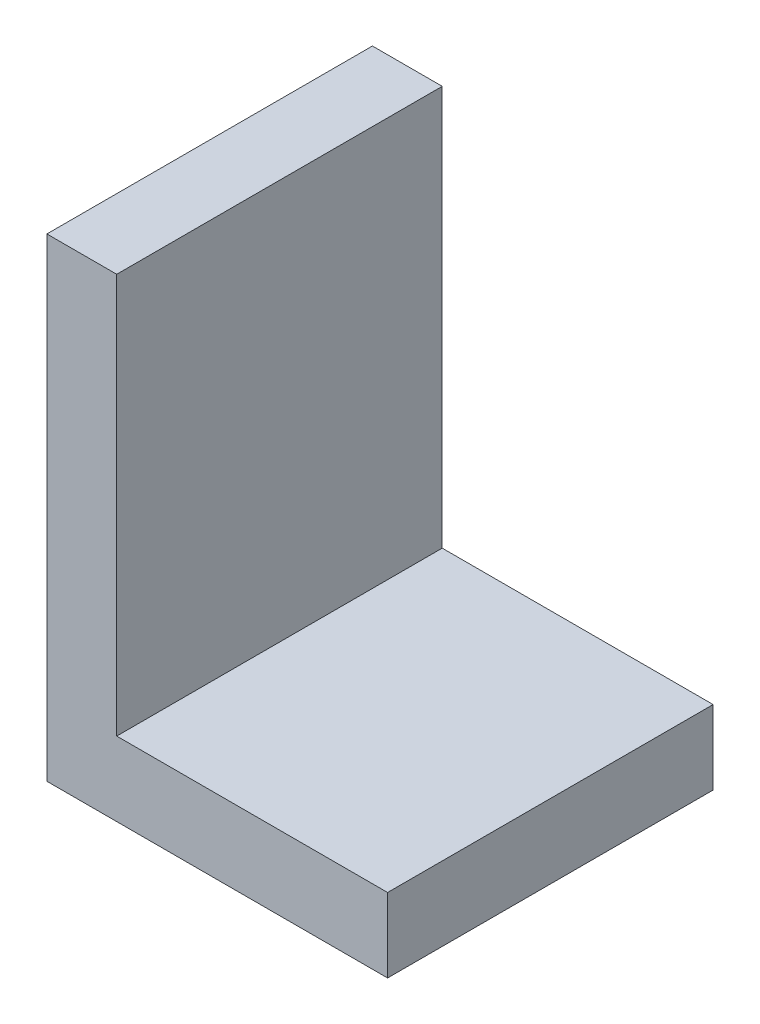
from build123d import *

# Parameters (mm, degrees)
EXTRUDE1_DEPTH = 32.639


with BuildPart() as part:
    # Sketch1 → Extrude1 (new, symmetric)
    with BuildSketch(Plane.XY):
        Polygon((0, 0), (0, 95.058464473), (14.004148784, 95.058464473), (14.004148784, 14.852885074), (68.32327134, 14.852885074), (68.32327134, 0), align=None)
    extrude(amount=EXTRUDE1_DEPTH, both=True)


solid = part.part
